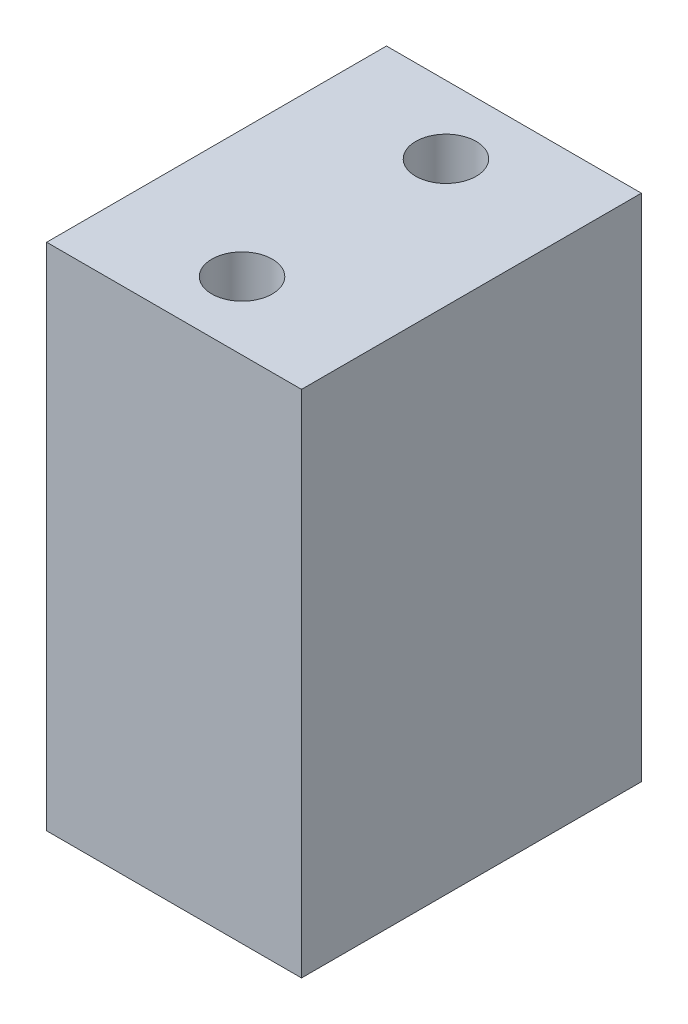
ISO-10303-21;
HEADER;
FILE_DESCRIPTION(('STEP AP214'),'2;1');
FILE_NAME('part.step','',(''),(''),'','','');
FILE_SCHEMA(('AUTOMOTIVE_DESIGN { 1 0 10303 214 1 1 1 1 }'));
ENDSEC;
DATA;
#1=APPLICATION_CONTEXT('core data for automotive mechanical design processes');
#2=APPLICATION_PROTOCOL_DEFINITION('international standard','automotive_design',2000,#1);
#3=PRODUCT_CONTEXT('',#1,'mechanical');
#4=PRODUCT('Part','Part','',(#3));
#5=PRODUCT_RELATED_PRODUCT_CATEGORY('part','',(#4));
#6=PRODUCT_DEFINITION_FORMATION('','',#4);
#7=PRODUCT_DEFINITION_CONTEXT('part definition',#1,'design');
#8=PRODUCT_DEFINITION('design','',#6,#7);
#9=PRODUCT_DEFINITION_SHAPE('','',#8);
#10=(LENGTH_UNIT() NAMED_UNIT(*) SI_UNIT(.MILLI.,.METRE.));
#11=(NAMED_UNIT(*) PLANE_ANGLE_UNIT() SI_UNIT($,.RADIAN.));
#12=(NAMED_UNIT(*) SI_UNIT($,.STERADIAN.) SOLID_ANGLE_UNIT());
#13=UNCERTAINTY_MEASURE_WITH_UNIT(LENGTH_MEASURE(1.E-05),#10,'distance_accuracy_value','');
#14=(GEOMETRIC_REPRESENTATION_CONTEXT(3) GLOBAL_UNCERTAINTY_ASSIGNED_CONTEXT((#13)) GLOBAL_UNIT_ASSIGNED_CONTEXT((#10,
#11,#12)) REPRESENTATION_CONTEXT('',''));
#15=CARTESIAN_POINT('',(0.,0.,0.));
#16=DIRECTION('',(0.,0.,1.));
#17=DIRECTION('',(1.,0.,0.));
#18=AXIS2_PLACEMENT_3D('',#15,#16,#17);
#19=CARTESIAN_POINT('',(0.,0.,12.7));
#20=DIRECTION('',(1.,0.,0.));
#21=DIRECTION('',(0.,0.,-1.));
#22=AXIS2_PLACEMENT_3D('',#19,#20,#21);
#23=PLANE('',#22);
#24=DIRECTION('',(0.,-1.,0.));
#25=VECTOR('',#24,1.);
#26=CARTESIAN_POINT('',(0.,0.,0.));
#27=LINE('',#26,#25);
#28=CARTESIAN_POINT('',(0.,19.05,0.));
#29=VERTEX_POINT('',#28);
#30=CARTESIAN_POINT('',(0.,0.,0.));
#31=VERTEX_POINT('',#30);
#32=EDGE_CURVE('E140',#29,#31,#27,.T.);
#33=ORIENTED_EDGE('',*,*,#32,.T.);
#34=DIRECTION('',(0.,0.,-1.));
#35=VECTOR('',#34,1.);
#36=CARTESIAN_POINT('',(0.,0.,12.7));
#37=LINE('',#36,#35);
#38=CARTESIAN_POINT('',(0.,0.,12.7));
#39=VERTEX_POINT('',#38);
#40=EDGE_CURVE('E11',#39,#31,#37,.T.);
#41=ORIENTED_EDGE('',*,*,#40,.F.);
#42=DIRECTION('',(0.,-1.,0.));
#43=VECTOR('',#42,1.);
#44=CARTESIAN_POINT('',(0.,0.,12.7));
#45=LINE('',#44,#43);
#46=CARTESIAN_POINT('',(0.,19.05,12.7));
#47=VERTEX_POINT('',#46);
#48=EDGE_CURVE('E141',#47,#39,#45,.T.);
#49=ORIENTED_EDGE('',*,*,#48,.F.);
#50=DIRECTION('',(0.,0.,-1.));
#51=VECTOR('',#50,1.);
#52=CARTESIAN_POINT('',(0.,19.05,12.7));
#53=LINE('',#52,#51);
#54=EDGE_CURVE('E147',#47,#29,#53,.T.);
#55=ORIENTED_EDGE('',*,*,#54,.T.);
#56=EDGE_LOOP('',(#33,#41,#49,#55));
#57=FACE_BOUND('',#56,.T.);
#58=ADVANCED_FACE('F47',(#57),#23,.F.);
#59=CARTESIAN_POINT('',(0.,0.,12.7));
#60=DIRECTION('',(0.,1.,0.));
#61=DIRECTION('',(0.,0.,1.));
#62=AXIS2_PLACEMENT_3D('',#59,#60,#61);
#63=PLANE('',#62);
#64=CARTESIAN_POINT('',(4.7625,0.,10.795));
#65=DIRECTION('',(0.,-1.,0.));
#66=DIRECTION('',(0.,0.,-1.));
#67=AXIS2_PLACEMENT_3D('',#64,#65,#66);
#68=CIRCLE('',#67,1.13029999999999);
#69=CARTESIAN_POINT('',(4.7625,0.,9.66470000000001));
#70=VERTEX_POINT('',#69);
#71=EDGE_CURVE('E118',#70,#70,#68,.T.);
#72=ORIENTED_EDGE('',*,*,#71,.F.);
#73=EDGE_LOOP('',(#72));
#74=FACE_BOUND('',#73,.T.);
#75=CARTESIAN_POINT('',(4.7625,0.,1.905));
#76=DIRECTION('',(0.,-1.,0.));
#77=DIRECTION('',(0.,0.,-1.));
#78=AXIS2_PLACEMENT_3D('',#75,#76,#77);
#79=CIRCLE('',#78,1.13029999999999);
#80=CARTESIAN_POINT('',(4.7625,0.,0.774700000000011));
#81=VERTEX_POINT('',#80);
#82=EDGE_CURVE('E117',#81,#81,#79,.T.);
#83=ORIENTED_EDGE('',*,*,#82,.F.);
#84=EDGE_LOOP('',(#83));
#85=FACE_BOUND('',#84,.T.);
#86=DIRECTION('',(1.,0.,0.));
#87=VECTOR('',#86,1.);
#88=CARTESIAN_POINT('',(0.,0.,0.));
#89=LINE('',#88,#87);
#90=CARTESIAN_POINT('',(9.525,0.,0.));
#91=VERTEX_POINT('',#90);
#92=EDGE_CURVE('E150',#31,#91,#89,.T.);
#93=ORIENTED_EDGE('',*,*,#92,.T.);
#94=DIRECTION('',(0.,0.,-1.));
#95=VECTOR('',#94,1.);
#96=CARTESIAN_POINT('',(9.525,0.,12.7));
#97=LINE('',#96,#95);
#98=CARTESIAN_POINT('',(9.525,0.,12.7));
#99=VERTEX_POINT('',#98);
#100=EDGE_CURVE('E55',#99,#91,#97,.T.);
#101=ORIENTED_EDGE('',*,*,#100,.F.);
#102=DIRECTION('',(1.,0.,0.));
#103=VECTOR('',#102,1.);
#104=CARTESIAN_POINT('',(0.,0.,12.7));
#105=LINE('',#104,#103);
#106=EDGE_CURVE('E94',#39,#99,#105,.T.);
#107=ORIENTED_EDGE('',*,*,#106,.F.);
#108=ORIENTED_EDGE('',*,*,#40,.T.);
#109=EDGE_LOOP('',(#93,#101,#107,#108));
#110=FACE_BOUND('',#109,.T.);
#111=ADVANCED_FACE('F176',(#74,#85,#110),#63,.F.);
#112=CARTESIAN_POINT('',(9.525,0.,12.7));
#113=DIRECTION('',(-1.,0.,0.));
#114=DIRECTION('',(0.,0.,1.));
#115=AXIS2_PLACEMENT_3D('',#112,#113,#114);
#116=PLANE('',#115);
#117=DIRECTION('',(0.,1.,0.));
#118=VECTOR('',#117,1.);
#119=CARTESIAN_POINT('',(9.525,0.,0.));
#120=LINE('',#119,#118);
#121=CARTESIAN_POINT('',(9.525,19.05,0.));
#122=VERTEX_POINT('',#121);
#123=EDGE_CURVE('E81',#91,#122,#120,.T.);
#124=ORIENTED_EDGE('',*,*,#123,.T.);
#125=DIRECTION('',(0.,0.,-1.));
#126=VECTOR('',#125,1.);
#127=CARTESIAN_POINT('',(9.525,19.05,12.7));
#128=LINE('',#127,#126);
#129=CARTESIAN_POINT('',(9.525,19.05,12.7));
#130=VERTEX_POINT('',#129);
#131=EDGE_CURVE('E155',#130,#122,#128,.T.);
#132=ORIENTED_EDGE('',*,*,#131,.F.);
#133=DIRECTION('',(0.,1.,0.));
#134=VECTOR('',#133,1.);
#135=CARTESIAN_POINT('',(9.525,0.,12.7));
#136=LINE('',#135,#134);
#137=EDGE_CURVE('E144',#99,#130,#136,.T.);
#138=ORIENTED_EDGE('',*,*,#137,.F.);
#139=ORIENTED_EDGE('',*,*,#100,.T.);
#140=EDGE_LOOP('',(#124,#132,#138,#139));
#141=FACE_BOUND('',#140,.T.);
#142=ADVANCED_FACE('F157',(#141),#116,.F.);
#143=CARTESIAN_POINT('',(0.,19.05,12.7));
#144=DIRECTION('',(0.,-1.,0.));
#145=DIRECTION('',(0.,0.,-1.));
#146=AXIS2_PLACEMENT_3D('',#143,#144,#145);
#147=PLANE('',#146);
#148=CARTESIAN_POINT('',(4.7625,19.05,2.54));
#149=DIRECTION('',(0.,1.,0.));
#150=DIRECTION('',(0.,0.,1.));
#151=AXIS2_PLACEMENT_3D('',#148,#149,#150);
#152=CIRCLE('',#151,1.13029999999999);
#153=CARTESIAN_POINT('',(4.7625,19.05,3.67029999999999));
#154=VERTEX_POINT('',#153);
#155=EDGE_CURVE('E128',#154,#154,#152,.T.);
#156=ORIENTED_EDGE('',*,*,#155,.F.);
#157=EDGE_LOOP('',(#156));
#158=FACE_BOUND('',#157,.T.);
#159=CARTESIAN_POINT('',(4.7625,19.05,10.16));
#160=DIRECTION('',(0.,1.,0.));
#161=DIRECTION('',(0.,0.,1.));
#162=AXIS2_PLACEMENT_3D('',#159,#160,#161);
#163=CIRCLE('',#162,1.13029999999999);
#164=CARTESIAN_POINT('',(4.7625,19.05,11.2903));
#165=VERTEX_POINT('',#164);
#166=EDGE_CURVE('E134',#165,#165,#163,.T.);
#167=ORIENTED_EDGE('',*,*,#166,.F.);
#168=EDGE_LOOP('',(#167));
#169=FACE_BOUND('',#168,.T.);
#170=DIRECTION('',(-1.,0.,0.));
#171=VECTOR('',#170,1.);
#172=CARTESIAN_POINT('',(0.,19.05,0.));
#173=LINE('',#172,#171);
#174=EDGE_CURVE('E87',#122,#29,#173,.T.);
#175=ORIENTED_EDGE('',*,*,#174,.T.);
#176=ORIENTED_EDGE('',*,*,#54,.F.);
#177=DIRECTION('',(-1.,0.,0.));
#178=VECTOR('',#177,1.);
#179=CARTESIAN_POINT('',(0.,19.05,12.7));
#180=LINE('',#179,#178);
#181=EDGE_CURVE('E63',#130,#47,#180,.T.);
#182=ORIENTED_EDGE('',*,*,#181,.F.);
#183=ORIENTED_EDGE('',*,*,#131,.T.);
#184=EDGE_LOOP('',(#175,#176,#182,#183));
#185=FACE_BOUND('',#184,.T.);
#186=ADVANCED_FACE('F164',(#158,#169,#185),#147,.F.);
#187=CARTESIAN_POINT('',(0.,0.,12.7));
#188=DIRECTION('',(0.,0.,-1.));
#189=DIRECTION('',(-1.,0.,0.));
#190=AXIS2_PLACEMENT_3D('',#187,#188,#189);
#191=PLANE('',#190);
#192=ORIENTED_EDGE('',*,*,#48,.T.);
#193=ORIENTED_EDGE('',*,*,#106,.T.);
#194=ORIENTED_EDGE('',*,*,#137,.T.);
#195=ORIENTED_EDGE('',*,*,#181,.T.);
#196=EDGE_LOOP('',(#192,#193,#194,#195));
#197=FACE_BOUND('',#196,.T.);
#198=ADVANCED_FACE('F166',(#197),#191,.F.);
#199=CARTESIAN_POINT('',(0.,0.,0.));
#200=DIRECTION('',(0.,0.,-1.));
#201=DIRECTION('',(-1.,0.,0.));
#202=AXIS2_PLACEMENT_3D('',#199,#200,#201);
#203=PLANE('',#202);
#204=ORIENTED_EDGE('',*,*,#32,.F.);
#205=ORIENTED_EDGE('',*,*,#174,.F.);
#206=ORIENTED_EDGE('',*,*,#123,.F.);
#207=ORIENTED_EDGE('',*,*,#92,.F.);
#208=EDGE_LOOP('',(#204,#205,#206,#207));
#209=FACE_BOUND('',#208,.T.);
#210=ADVANCED_FACE('F160',(#209),#203,.T.);
#211=CARTESIAN_POINT('',(4.7625,11.43,10.16));
#212=DIRECTION('',(0.,1.,0.));
#213=DIRECTION('',(0.,0.,1.));
#214=AXIS2_PLACEMENT_3D('',#211,#212,#213);
#215=CONICAL_SURFACE('',#214,1.13029999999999,1.02974425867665);
#216=CARTESIAN_POINT('',(4.7625,10.7508472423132,10.16));
#217=VERTEX_POINT('',#216);
#218=VERTEX_LOOP('',#217);
#219=FACE_BOUND('',#218,.T.);
#220=CARTESIAN_POINT('',(4.7625,11.43,10.16));
#221=DIRECTION('',(0.,1.,0.));
#222=DIRECTION('',(0.,0.,1.));
#223=AXIS2_PLACEMENT_3D('',#220,#221,#222);
#224=CIRCLE('',#223,1.13029999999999);
#225=CARTESIAN_POINT('',(4.7625,11.43,11.2903));
#226=VERTEX_POINT('',#225);
#227=EDGE_CURVE('E137',#226,#226,#224,.T.);
#228=ORIENTED_EDGE('',*,*,#227,.T.);
#229=EDGE_LOOP('',(#228));
#230=FACE_BOUND('',#229,.T.);
#231=ADVANCED_FACE('F216',(#219,#230),#215,.F.);
#232=CARTESIAN_POINT('',(4.7625,19.05,10.16));
#233=DIRECTION('',(0.,1.,0.));
#234=DIRECTION('',(0.,0.,1.));
#235=AXIS2_PLACEMENT_3D('',#232,#233,#234);
#236=CYLINDRICAL_SURFACE('',#235,1.13029999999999);
#237=ORIENTED_EDGE('',*,*,#227,.F.);
#238=EDGE_LOOP('',(#237));
#239=FACE_BOUND('',#238,.T.);
#240=ORIENTED_EDGE('',*,*,#166,.T.);
#241=EDGE_LOOP('',(#240));
#242=FACE_BOUND('',#241,.T.);
#243=ADVANCED_FACE('F213',(#239,#242),#236,.F.);
#244=CARTESIAN_POINT('',(4.7625,11.43,2.54));
#245=DIRECTION('',(0.,1.,0.));
#246=DIRECTION('',(0.,0.,1.));
#247=AXIS2_PLACEMENT_3D('',#244,#245,#246);
#248=CONICAL_SURFACE('',#247,1.13029999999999,1.02974425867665);
#249=CARTESIAN_POINT('',(4.7625,10.7508472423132,2.54));
#250=VERTEX_POINT('',#249);
#251=VERTEX_LOOP('',#250);
#252=FACE_BOUND('',#251,.T.);
#253=CARTESIAN_POINT('',(4.7625,11.43,2.54));
#254=DIRECTION('',(0.,1.,0.));
#255=DIRECTION('',(0.,0.,1.));
#256=AXIS2_PLACEMENT_3D('',#253,#254,#255);
#257=CIRCLE('',#256,1.13029999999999);
#258=CARTESIAN_POINT('',(4.7625,11.43,3.67029999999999));
#259=VERTEX_POINT('',#258);
#260=EDGE_CURVE('E131',#259,#259,#257,.T.);
#261=ORIENTED_EDGE('',*,*,#260,.T.);
#262=EDGE_LOOP('',(#261));
#263=FACE_BOUND('',#262,.T.);
#264=ADVANCED_FACE('F209',(#252,#263),#248,.F.);
#265=CARTESIAN_POINT('',(4.7625,19.05,2.54));
#266=DIRECTION('',(0.,1.,0.));
#267=DIRECTION('',(0.,0.,1.));
#268=AXIS2_PLACEMENT_3D('',#265,#266,#267);
#269=CYLINDRICAL_SURFACE('',#268,1.13029999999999);
#270=ORIENTED_EDGE('',*,*,#260,.F.);
#271=EDGE_LOOP('',(#270));
#272=FACE_BOUND('',#271,.T.);
#273=ORIENTED_EDGE('',*,*,#155,.T.);
#274=EDGE_LOOP('',(#273));
#275=FACE_BOUND('',#274,.T.);
#276=ADVANCED_FACE('F201',(#272,#275),#269,.F.);
#277=CARTESIAN_POINT('',(4.7625,7.62,1.905));
#278=DIRECTION('',(0.,-1.,0.));
#279=DIRECTION('',(0.,0.,-1.));
#280=AXIS2_PLACEMENT_3D('',#277,#278,#279);
#281=CONICAL_SURFACE('',#280,1.13029999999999,1.02974425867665);
#282=CARTESIAN_POINT('',(4.7625,8.29915275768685,1.905));
#283=VERTEX_POINT('',#282);
#284=VERTEX_LOOP('',#283);
#285=FACE_BOUND('',#284,.T.);
#286=CARTESIAN_POINT('',(4.7625,7.62,1.905));
#287=DIRECTION('',(0.,-1.,0.));
#288=DIRECTION('',(0.,0.,-1.));
#289=AXIS2_PLACEMENT_3D('',#286,#287,#288);
#290=CIRCLE('',#289,1.13029999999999);
#291=CARTESIAN_POINT('',(4.7625,7.62,0.774700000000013));
#292=VERTEX_POINT('',#291);
#293=EDGE_CURVE('E121',#292,#292,#290,.T.);
#294=ORIENTED_EDGE('',*,*,#293,.T.);
#295=EDGE_LOOP('',(#294));
#296=FACE_BOUND('',#295,.T.);
#297=ADVANCED_FACE('F195',(#285,#296),#281,.F.);
#298=CARTESIAN_POINT('',(4.7625,0.,1.905));
#299=DIRECTION('',(0.,-1.,0.));
#300=DIRECTION('',(0.,0.,-1.));
#301=AXIS2_PLACEMENT_3D('',#298,#299,#300);
#302=CYLINDRICAL_SURFACE('',#301,1.13029999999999);
#303=ORIENTED_EDGE('',*,*,#293,.F.);
#304=EDGE_LOOP('',(#303));
#305=FACE_BOUND('',#304,.T.);
#306=ORIENTED_EDGE('',*,*,#82,.T.);
#307=EDGE_LOOP('',(#306));
#308=FACE_BOUND('',#307,.T.);
#309=ADVANCED_FACE('F111',(#305,#308),#302,.F.);
#310=CARTESIAN_POINT('',(4.7625,7.62,10.795));
#311=DIRECTION('',(0.,-1.,0.));
#312=DIRECTION('',(0.,0.,-1.));
#313=AXIS2_PLACEMENT_3D('',#310,#311,#312);
#314=CONICAL_SURFACE('',#313,1.13029999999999,1.02974425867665);
#315=CARTESIAN_POINT('',(4.7625,8.29915275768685,10.795));
#316=VERTEX_POINT('',#315);
#317=VERTEX_LOOP('',#316);
#318=FACE_BOUND('',#317,.T.);
#319=CARTESIAN_POINT('',(4.7625,7.62,10.795));
#320=DIRECTION('',(0.,-1.,0.));
#321=DIRECTION('',(0.,0.,-1.));
#322=AXIS2_PLACEMENT_3D('',#319,#320,#321);
#323=CIRCLE('',#322,1.13029999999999);
#324=CARTESIAN_POINT('',(4.7625,7.62,9.66470000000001));
#325=VERTEX_POINT('',#324);
#326=EDGE_CURVE('E115',#325,#325,#323,.T.);
#327=ORIENTED_EDGE('',*,*,#326,.T.);
#328=EDGE_LOOP('',(#327));
#329=FACE_BOUND('',#328,.T.);
#330=ADVANCED_FACE('F107',(#318,#329),#314,.F.);
#331=CARTESIAN_POINT('',(4.7625,0.,10.795));
#332=DIRECTION('',(0.,-1.,0.));
#333=DIRECTION('',(0.,0.,-1.));
#334=AXIS2_PLACEMENT_3D('',#331,#332,#333);
#335=CYLINDRICAL_SURFACE('',#334,1.13029999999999);
#336=ORIENTED_EDGE('',*,*,#326,.F.);
#337=EDGE_LOOP('',(#336));
#338=FACE_BOUND('',#337,.T.);
#339=ORIENTED_EDGE('',*,*,#71,.T.);
#340=EDGE_LOOP('',(#339));
#341=FACE_BOUND('',#340,.T.);
#342=ADVANCED_FACE('F110',(#338,#341),#335,.F.);
#343=CLOSED_SHELL('',(#58,#111,#142,#186,#198,#210,#231,#243,#264,#276,#297,#309,#330,#342));
#344=MANIFOLD_SOLID_BREP('B2',#343);
#345=ADVANCED_BREP_SHAPE_REPRESENTATION('',(#18,#344),#14);
#346=SHAPE_DEFINITION_REPRESENTATION(#9,#345);
ENDSEC;
END-ISO-10303-21;
